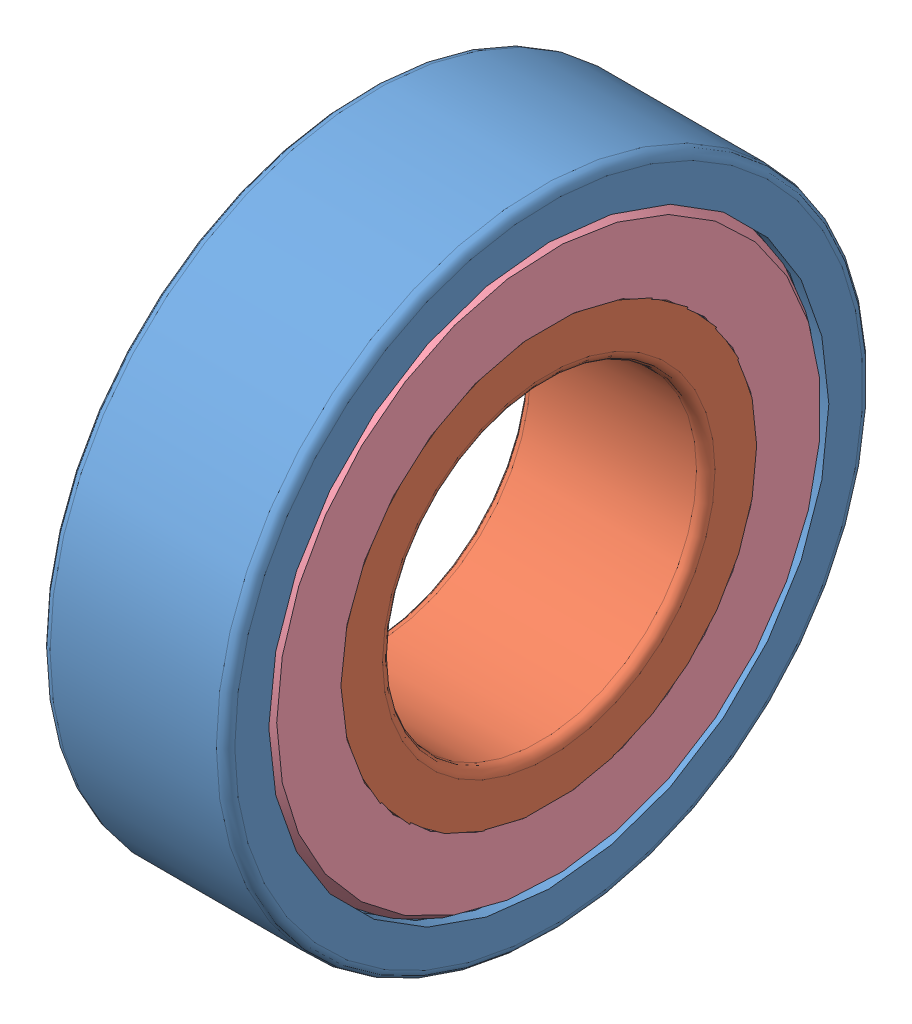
SolidWorks assembly Michaud_Chailly_L1_6003_2Z.sldasm, configuration Michaud Chailly L1-6003-2Z (file format 5000). Lengths in mm.
Overall size (10 35 35).
4 component instances, 4 part files, 0 mates.
Components (placement in the parent):
- Michaud_Chailly_L1_6003_2Z_PART1-1: Michaud_Chailly_L1_6003_2Z_PART1.sldprt [Default] at origin size (10 35 35)
- Michaud_Chailly_L1_6003_2Z_PART2-1: Michaud_Chailly_L1_6003_2Z_PART2.sldprt [Default] at origin size (10 22.51 22.51)
- Michaud_Chailly_L1_6003_2Z_PART3-1: Michaud_Chailly_L1_6003_2Z_PART3.sldprt [Default] at origin size (1 30.32 30.32)
- Michaud_Chailly_L1_6003_2Z_PART4-1: Michaud_Chailly_L1_6003_2Z_PART4.sldprt [Default] at origin size (1 30.32 30.32)
